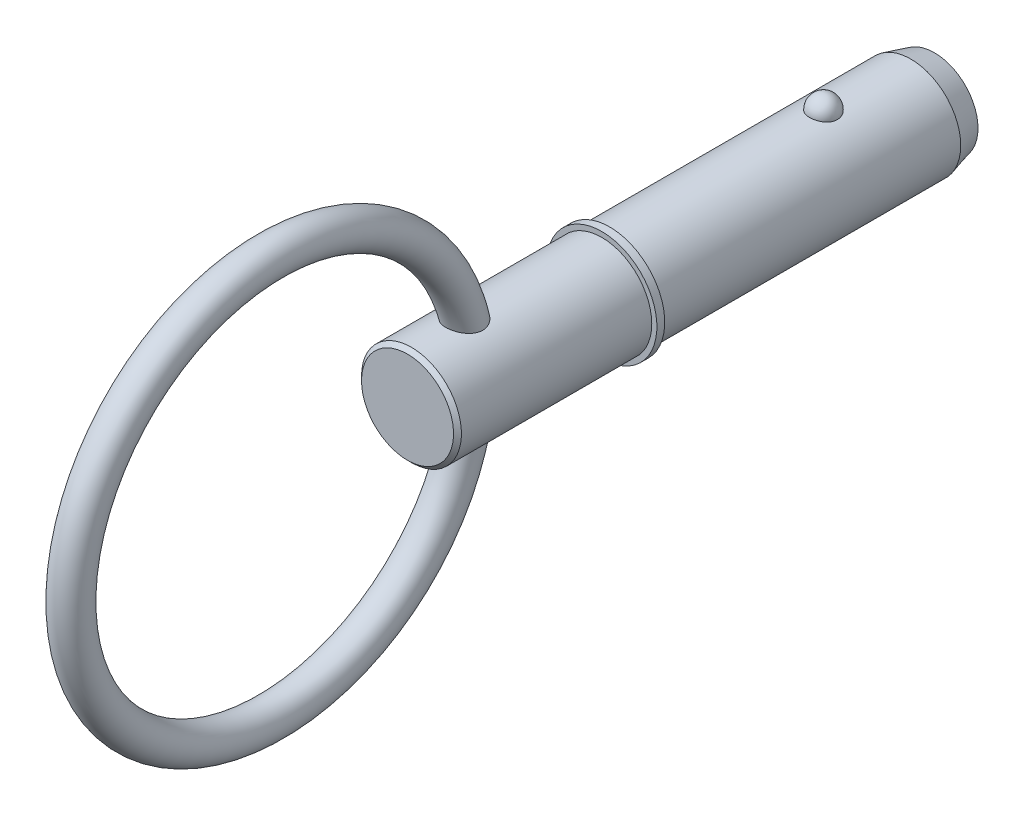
ISO-10303-21;
HEADER;
FILE_DESCRIPTION(('STEP AP214'),'2;1');
FILE_NAME('part.step','',(''),(''),'','','');
FILE_SCHEMA(('AUTOMOTIVE_DESIGN { 1 0 10303 214 1 1 1 1 }'));
ENDSEC;
DATA;
#1=APPLICATION_CONTEXT('core data for automotive mechanical design processes');
#2=APPLICATION_PROTOCOL_DEFINITION('international standard','automotive_design',2000,#1);
#3=PRODUCT_CONTEXT('',#1,'mechanical');
#4=PRODUCT('Part','Part','',(#3));
#5=PRODUCT_RELATED_PRODUCT_CATEGORY('part','',(#4));
#6=PRODUCT_DEFINITION_FORMATION('','',#4);
#7=PRODUCT_DEFINITION_CONTEXT('part definition',#1,'design');
#8=PRODUCT_DEFINITION('design','',#6,#7);
#9=PRODUCT_DEFINITION_SHAPE('','',#8);
#10=(LENGTH_UNIT() NAMED_UNIT(*) SI_UNIT(.MILLI.,.METRE.));
#11=(NAMED_UNIT(*) PLANE_ANGLE_UNIT() SI_UNIT($,.RADIAN.));
#12=(NAMED_UNIT(*) SI_UNIT($,.STERADIAN.) SOLID_ANGLE_UNIT());
#13=UNCERTAINTY_MEASURE_WITH_UNIT(LENGTH_MEASURE(1.E-05),#10,'distance_accuracy_value','');
#14=(GEOMETRIC_REPRESENTATION_CONTEXT(3) GLOBAL_UNCERTAINTY_ASSIGNED_CONTEXT((#13)) GLOBAL_UNIT_ASSIGNED_CONTEXT((#10,
#11,#12)) REPRESENTATION_CONTEXT('',''));
#15=CARTESIAN_POINT('',(0.,0.,0.));
#16=DIRECTION('',(0.,0.,1.));
#17=DIRECTION('',(1.,0.,0.));
#18=AXIS2_PLACEMENT_3D('',#15,#16,#17);
#19=CARTESIAN_POINT('',(0.,0.,25.4));
#20=DIRECTION('',(0.,0.,-1.));
#21=DIRECTION('',(-1.,0.,0.));
#22=AXIS2_PLACEMENT_3D('',#19,#20,#21);
#23=CYLINDRICAL_SURFACE('',#22,6.35);
#24=CARTESIAN_POINT('',(1.76243001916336,6.10051968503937,-1.78));
#25=CARTESIAN_POINT('',(1.76242835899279,6.10052111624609,-1.68050311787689));
#26=CARTESIAN_POINT('',(1.75431593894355,6.1028816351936,-1.58098521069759));
#27=CARTESIAN_POINT('',(1.72206027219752,6.11206037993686,-1.38476972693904));
#28=CARTESIAN_POINT('',(1.69791106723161,6.11888026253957,-1.28807321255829));
#29=CARTESIAN_POINT('',(1.63419596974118,6.13620287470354,-1.10029899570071));
#30=CARTESIAN_POINT('',(1.59463684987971,6.14670398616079,-1.00921884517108));
#31=CARTESIAN_POINT('',(1.50108569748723,6.17021534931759,-0.835161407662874));
#32=CARTESIAN_POINT('',(1.44709398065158,6.18322554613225,-0.752183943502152));
#33=CARTESIAN_POINT('',(1.3257243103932,6.21038081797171,-0.596209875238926));
#34=CARTESIAN_POINT('',(1.2582815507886,6.22453118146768,-0.523264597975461));
#35=CARTESIAN_POINT('',(1.11191624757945,6.25233390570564,-0.389855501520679));
#36=CARTESIAN_POINT('',(1.03299369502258,6.26598626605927,-0.329391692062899));
#37=CARTESIAN_POINT('',(0.866022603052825,6.29123226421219,-0.222793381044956));
#38=CARTESIAN_POINT('',(0.778000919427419,6.30283170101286,-0.176618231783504));
#39=CARTESIAN_POINT('',(0.59510847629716,6.32272058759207,-0.0996905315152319));
#40=CARTESIAN_POINT('',(0.500238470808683,6.33101040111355,-0.0689362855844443));
#41=CARTESIAN_POINT('',(0.308164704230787,6.34323464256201,-0.0241595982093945));
#42=CARTESIAN_POINT('',(0.211033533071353,6.34724467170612,-0.00984637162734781));
#43=CARTESIAN_POINT('',(0.0156629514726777,6.3507318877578,0.00262058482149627));
#44=CARTESIAN_POINT('',(-0.0825763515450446,6.35020951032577,0.000775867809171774));
#45=CARTESIAN_POINT('',(-0.275890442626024,6.34473055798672,-0.018872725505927));
#46=CARTESIAN_POINT('',(-0.370990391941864,6.3398374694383,-0.0364481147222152));
#47=CARTESIAN_POINT('',(-0.556805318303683,6.32622723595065,-0.0867447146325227));
#48=CARTESIAN_POINT('',(-0.647520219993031,6.31751002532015,-0.119466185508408));
#49=CARTESIAN_POINT('',(-0.822606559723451,6.29711353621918,-0.199386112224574));
#50=CARTESIAN_POINT('',(-0.906938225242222,6.28541739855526,-0.246667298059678));
#51=CARTESIAN_POINT('',(-1.06646479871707,6.26032612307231,-0.354365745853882));
#52=CARTESIAN_POINT('',(-1.14165877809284,6.24693081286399,-0.414784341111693));
#53=CARTESIAN_POINT('',(-1.2823514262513,6.21959142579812,-0.548435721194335));
#54=CARTESIAN_POINT('',(-1.34763761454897,6.2056417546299,-0.621891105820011));
#55=CARTESIAN_POINT('',(-1.4651153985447,6.17896241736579,-0.778815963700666));
#56=CARTESIAN_POINT('',(-1.51730606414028,6.16623283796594,-0.862286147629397));
#57=CARTESIAN_POINT('',(-1.60782211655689,6.14325839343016,-1.0379915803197));
#58=CARTESIAN_POINT('',(-1.64598111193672,6.13304379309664,-1.13031660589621));
#59=CARTESIAN_POINT('',(-1.70661885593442,6.11644899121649,-1.32030667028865));
#60=CARTESIAN_POINT('',(-1.72909805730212,6.11006867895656,-1.41797155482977));
#61=CARTESIAN_POINT('',(-1.75775019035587,6.1018881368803,-1.61543246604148));
#62=CARTESIAN_POINT('',(-1.76399136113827,6.10006874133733,-1.71521779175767));
#63=CARTESIAN_POINT('',(-1.76020715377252,6.10116172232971,-1.91445126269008));
#64=CARTESIAN_POINT('',(-1.75018221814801,6.10407397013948,-2.01389941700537));
#65=CARTESIAN_POINT('',(-1.71421005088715,6.11427232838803,-2.20912106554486));
#66=CARTESIAN_POINT('',(-1.68834262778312,6.12153651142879,-2.30491043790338));
#67=CARTESIAN_POINT('',(-1.62139543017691,6.1396067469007,-2.49066180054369));
#68=CARTESIAN_POINT('',(-1.5803150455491,6.15041294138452,-2.58062355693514));
#69=CARTESIAN_POINT('',(-1.48369112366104,6.17443456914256,-2.75271428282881));
#70=CARTESIAN_POINT('',(-1.42806998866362,6.18766281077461,-2.83479789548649));
#71=CARTESIAN_POINT('',(-1.30386620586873,6.21501934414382,-2.98832532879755));
#72=CARTESIAN_POINT('',(-1.23528306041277,6.22914767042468,-3.05976874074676));
#73=CARTESIAN_POINT('',(-1.08663999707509,6.25679135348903,-3.19029656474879));
#74=CARTESIAN_POINT('',(-1.00653826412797,6.27030422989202,-3.24933392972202));
#75=CARTESIAN_POINT('',(-0.837212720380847,6.29514770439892,-3.35304657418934));
#76=CARTESIAN_POINT('',(-0.747989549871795,6.30647845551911,-3.39772286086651));
#77=CARTESIAN_POINT('',(-0.564098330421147,6.32556124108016,-3.47096393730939));
#78=CARTESIAN_POINT('',(-0.469512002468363,6.33335611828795,-3.49972259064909));
#79=CARTESIAN_POINT('',(-0.27663389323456,6.34470628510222,-3.54113722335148));
#80=CARTESIAN_POINT('',(-0.17834256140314,6.34826208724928,-3.55379514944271));
#81=CARTESIAN_POINT('',(0.0171660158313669,6.35071525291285,-3.56255473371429));
#82=CARTESIAN_POINT('',(0.114368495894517,6.34969931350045,-3.55896450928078));
#83=CARTESIAN_POINT('',(0.306746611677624,6.34331695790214,-3.53603383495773));
#84=CARTESIAN_POINT('',(0.401922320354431,6.33795069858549,-3.51669395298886));
#85=CARTESIAN_POINT('',(0.587203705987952,6.32347219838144,-3.4629173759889));
#86=CARTESIAN_POINT('',(0.677327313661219,6.31437430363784,-3.42853846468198));
#87=CARTESIAN_POINT('',(0.850462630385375,6.29339543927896,-3.34564128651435));
#88=CARTESIAN_POINT('',(0.933473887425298,6.2815142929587,-3.29712212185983));
#89=CARTESIAN_POINT('',(1.09144542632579,6.25601750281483,-3.18638742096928));
#90=CARTESIAN_POINT('',(1.16626195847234,6.24237795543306,-3.12397237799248));
#91=CARTESIAN_POINT('',(1.304448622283,6.21497285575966,-2.98755865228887));
#92=CARTESIAN_POINT('',(1.36781676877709,6.20120728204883,-2.91355796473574));
#93=CARTESIAN_POINT('',(1.48252779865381,6.17479923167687,-2.75456133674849));
#94=CARTESIAN_POINT('',(1.53364167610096,6.16218052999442,-2.66939613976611));
#95=CARTESIAN_POINT('',(1.62109397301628,6.13975602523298,-2.49147502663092));
#96=CARTESIAN_POINT('',(1.657437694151,6.12994921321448,-2.39872184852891));
#97=CARTESIAN_POINT('',(1.71127844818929,6.11512175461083,-2.21887622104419));
#98=CARTESIAN_POINT('',(1.73042646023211,6.10968903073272,-2.13230770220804));
#99=CARTESIAN_POINT('',(1.75600284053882,6.10238739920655,-1.95716498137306));
#100=CARTESIAN_POINT('',(1.76243149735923,6.10051841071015,-1.86859082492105));
#101=CARTESIAN_POINT('',(1.76243001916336,6.10051968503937,-1.78));
#102=B_SPLINE_CURVE_WITH_KNOTS('',3,(#24,#25,#26,#27,#28,#29,#30,#31,#32,#33,#34,#35,#36,#37,
#38,#39,#40,#41,#42,#43,#44,#45,#46,#47,#48,#49,#50,#51,#52,#53,#54,#55,#56,#57,#58,#59,#60,#61,
#62,#63,#64,#65,#66,#67,#68,#69,#70,#71,#72,#73,#74,#75,#76,#77,#78,#79,#80,#81,#82,#83,#84,#85,
#86,#87,#88,#89,#90,#91,#92,#93,#94,#95,#96,#97,#98,#99,#100,#101),.UNSPECIFIED.,.T.,.F.,(4,2,2,
2,2,2,2,2,2,2,2,2,2,2,2,2,2,2,2,2,2,2,2,2,2,2,2,2,2,2,2,2,2,2,2,2,2,2,4),(0.,0.298172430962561,
0.596455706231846,0.894608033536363,1.19275383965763,1.49237238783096,1.79199116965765,
2.09074960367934,2.38947519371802,2.68283180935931,2.97616022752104,3.26529599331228,
3.5544367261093,3.84525169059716,4.13609618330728,4.43249276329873,4.72891038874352,
5.02873757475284,5.32855610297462,5.62711261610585,5.92566100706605,6.22271765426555,
6.519786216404,6.81847366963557,7.11717259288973,7.41698459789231,7.71677557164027,
8.01283014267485,8.30884891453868,8.59927798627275,8.88969658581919,9.17900899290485,
9.46833977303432,9.76212836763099,10.0559678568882,10.3549321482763,10.6537890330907,
10.9192841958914,11.1847733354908),.UNSPECIFIED.);
#103=CARTESIAN_POINT('',(1.76243001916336,6.10051968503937,-1.78));
#104=VERTEX_POINT('',#103);
#105=EDGE_CURVE('E102',#104,#104,#102,.T.);
#106=ORIENTED_EDGE('',*,*,#105,.T.);
#107=EDGE_LOOP('',(#106));
#108=FACE_BOUND('',#107,.T.);
#109=CARTESIAN_POINT('',(0.,0.,-12.88));
#110=DIRECTION('',(0.,0.,-1.));
#111=DIRECTION('',(-1.,0.,0.));
#112=AXIS2_PLACEMENT_3D('',#109,#110,#111);
#113=CIRCLE('',#112,6.35);
#114=CARTESIAN_POINT('',(6.35,0.,-12.88));
#115=VERTEX_POINT('',#114);
#116=EDGE_CURVE('E109',#115,#115,#113,.F.);
#117=ORIENTED_EDGE('',*,*,#116,.T.);
#118=EDGE_LOOP('',(#117));
#119=FACE_BOUND('',#118,.T.);
#120=CARTESIAN_POINT('',(0.,0.,25.4));
#121=DIRECTION('',(0.,0.,1.));
#122=DIRECTION('',(1.,0.,0.));
#123=AXIS2_PLACEMENT_3D('',#120,#121,#122);
#124=CIRCLE('',#123,6.35);
#125=CARTESIAN_POINT('',(6.35,0.,25.4));
#126=VERTEX_POINT('',#125);
#127=EDGE_CURVE('E107',#126,#126,#124,.T.);
#128=ORIENTED_EDGE('',*,*,#127,.F.);
#129=EDGE_LOOP('',(#128));
#130=FACE_BOUND('',#129,.T.);
#131=ADVANCED_FACE('F39',(#108,#119,#130),#23,.T.);
#132=CARTESIAN_POINT('',(0.,0.,-15.88));
#133=DIRECTION('',(0.,0.,-1.));
#134=DIRECTION('',(-1.,0.,0.));
#135=AXIS2_PLACEMENT_3D('',#132,#133,#134);
#136=PLANE('',#135);
#137=CARTESIAN_POINT('',(0.,0.,-15.88));
#138=DIRECTION('',(0.,0.,-1.));
#139=DIRECTION('',(-1.,0.,0.));
#140=AXIS2_PLACEMENT_3D('',#137,#138,#139);
#141=CIRCLE('',#140,5.54615242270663);
#142=CARTESIAN_POINT('',(5.54615242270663,0.,-15.88));
#143=VERTEX_POINT('',#142);
#144=EDGE_CURVE('E141',#143,#143,#141,.T.);
#145=ORIENTED_EDGE('',*,*,#144,.T.);
#146=EDGE_LOOP('',(#145));
#147=FACE_BOUND('',#146,.T.);
#148=ADVANCED_FACE('F88',(#147),#136,.T.);
#149=CARTESIAN_POINT('',(0.,0.,-15.88));
#150=DIRECTION('',(0.,0.,1.));
#151=DIRECTION('',(1.,0.,0.));
#152=AXIS2_PLACEMENT_3D('',#149,#150,#151);
#153=CONICAL_SURFACE('',#152,5.54615242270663,0.261799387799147);
#154=CARTESIAN_POINT('',(6.35,0.,-12.88));
#155=CARTESIAN_POINT('',(6.34162658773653,0.,-12.91125));
#156=CARTESIAN_POINT('',(6.33325317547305,0.,-12.9425));
#157=CARTESIAN_POINT('',(6.31650635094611,0.,-13.005));
#158=CARTESIAN_POINT('',(6.30813293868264,0.,-13.03625));
#159=CARTESIAN_POINT('',(6.29138611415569,0.,-13.09875));
#160=CARTESIAN_POINT('',(6.28301270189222,0.,-13.13));
#161=CARTESIAN_POINT('',(6.26626587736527,0.,-13.1925));
#162=CARTESIAN_POINT('',(6.2578924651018,0.,-13.22375));
#163=CARTESIAN_POINT('',(6.24114564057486,0.,-13.28625));
#164=CARTESIAN_POINT('',(6.23277222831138,0.,-13.3175));
#165=CARTESIAN_POINT('',(6.21602540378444,0.,-13.38));
#166=CARTESIAN_POINT('',(6.20765199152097,0.,-13.41125));
#167=CARTESIAN_POINT('',(6.19090516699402,0.,-13.47375));
#168=CARTESIAN_POINT('',(6.18253175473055,0.,-13.505));
#169=CARTESIAN_POINT('',(6.1657849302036,0.,-13.5675));
#170=CARTESIAN_POINT('',(6.15741151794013,0.,-13.59875));
#171=CARTESIAN_POINT('',(6.14066469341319,0.,-13.66125));
#172=CARTESIAN_POINT('',(6.13229128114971,0.,-13.6925));
#173=CARTESIAN_POINT('',(6.11554445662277,0.,-13.755));
#174=CARTESIAN_POINT('',(6.1071710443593,0.,-13.78625));
#175=CARTESIAN_POINT('',(6.09042421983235,0.,-13.84875));
#176=CARTESIAN_POINT('',(6.08205080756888,0.,-13.88));
#177=CARTESIAN_POINT('',(6.06530398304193,0.,-13.9425));
#178=CARTESIAN_POINT('',(6.05693057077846,0.,-13.97375));
#179=CARTESIAN_POINT('',(6.04018374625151,0.,-14.03625));
#180=CARTESIAN_POINT('',(6.03181033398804,0.,-14.0675));
#181=CARTESIAN_POINT('',(6.0150635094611,0.,-14.13));
#182=CARTESIAN_POINT('',(6.00669009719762,0.,-14.16125));
#183=CARTESIAN_POINT('',(5.98994327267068,0.,-14.22375));
#184=CARTESIAN_POINT('',(5.98156986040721,0.,-14.255));
#185=CARTESIAN_POINT('',(5.96482303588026,0.,-14.3175));
#186=CARTESIAN_POINT('',(5.95644962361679,0.,-14.34875));
#187=CARTESIAN_POINT('',(5.93970279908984,0.,-14.41125));
#188=CARTESIAN_POINT('',(5.93132938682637,0.,-14.4425));
#189=CARTESIAN_POINT('',(5.91458256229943,0.,-14.505));
#190=CARTESIAN_POINT('',(5.90620915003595,0.,-14.53625));
#191=CARTESIAN_POINT('',(5.88946232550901,0.,-14.59875));
#192=CARTESIAN_POINT('',(5.88108891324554,0.,-14.63));
#193=CARTESIAN_POINT('',(5.86434208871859,0.,-14.6925));
#194=CARTESIAN_POINT('',(5.85596867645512,0.,-14.72375));
#195=CARTESIAN_POINT('',(5.83922185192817,0.,-14.78625));
#196=CARTESIAN_POINT('',(5.8308484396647,0.,-14.8175));
#197=CARTESIAN_POINT('',(5.81410161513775,0.,-14.88));
#198=CARTESIAN_POINT('',(5.80572820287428,0.,-14.91125));
#199=CARTESIAN_POINT('',(5.78898137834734,0.,-14.97375));
#200=CARTESIAN_POINT('',(5.78060796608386,0.,-15.005));
#201=CARTESIAN_POINT('',(5.76386114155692,0.,-15.0675));
#202=CARTESIAN_POINT('',(5.75548772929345,0.,-15.09875));
#203=CARTESIAN_POINT('',(5.7387409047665,0.,-15.16125));
#204=CARTESIAN_POINT('',(5.73036749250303,0.,-15.1925));
#205=CARTESIAN_POINT('',(5.71362066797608,0.,-15.255));
#206=CARTESIAN_POINT('',(5.70524725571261,0.,-15.28625));
#207=CARTESIAN_POINT('',(5.68850043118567,0.,-15.34875));
#208=CARTESIAN_POINT('',(5.68012701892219,0.,-15.38));
#209=CARTESIAN_POINT('',(5.66338019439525,0.,-15.4425));
#210=CARTESIAN_POINT('',(5.65500678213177,0.,-15.47375));
#211=CARTESIAN_POINT('',(5.63825995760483,0.,-15.53625));
#212=CARTESIAN_POINT('',(5.62988654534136,0.,-15.5675));
#213=CARTESIAN_POINT('',(5.61313972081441,0.,-15.63));
#214=CARTESIAN_POINT('',(5.60476630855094,0.,-15.66125));
#215=CARTESIAN_POINT('',(5.588019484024,0.,-15.72375));
#216=CARTESIAN_POINT('',(5.57964607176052,0.,-15.755));
#217=CARTESIAN_POINT('',(5.56289924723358,0.,-15.8175));
#218=CARTESIAN_POINT('',(5.5545258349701,0.,-15.84875));
#219=CARTESIAN_POINT('',(5.54615242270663,0.,-15.88));
#220=B_SPLINE_CURVE_WITH_KNOTS('',3,(#154,#155,#156,#157,#158,#159,#160,#161,#162,#163,#164,
#165,#166,#167,#168,#169,#170,#171,#172,#173,#174,#175,#176,#177,#178,#179,#180,#181,#182,#183,
#184,#185,#186,#187,#188,#189,#190,#191,#192,#193,#194,#195,#196,#197,#198,#199,#200,#201,#202,
#203,#204,#205,#206,#207,#208,#209,#210,#211,#212,#213,#214,#215,#216,#217,#218,#219),
.UNSPECIFIED.,.F.,.F.,(4,2,2,2,2,2,2,2,2,2,2,2,2,2,2,2,2,2,2,2,2,2,2,2,2,2,2,2,2,2,2,2,4),(0.,
0.0970571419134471,0.194114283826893,0.291171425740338,0.388228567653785,0.485285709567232,
0.582342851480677,0.679399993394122,0.77645713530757,0.873514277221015,0.970571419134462,
1.06762856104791,1.16468570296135,1.2617428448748,1.35879998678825,1.45585712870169,
1.55291427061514,1.64997141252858,1.74702855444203,1.84408569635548,1.94114283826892,
2.03819998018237,2.13525712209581,2.23231426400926,2.32937140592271,2.42642854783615,
2.5234856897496,2.62054283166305,2.71759997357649,2.81465711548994,2.91171425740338,
3.00877139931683,3.10582854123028),.UNSPECIFIED.);
#221=EDGE_CURVE('BSEAM94',#115,#143,#220,.T.);
#222=ORIENTED_EDGE('',*,*,#116,.F.);
#223=ORIENTED_EDGE('',*,*,#144,.F.);
#224=ORIENTED_EDGE('',*,*,#221,.T.);
#225=ORIENTED_EDGE('',*,*,#221,.F.);
#226=EDGE_LOOP('',(#222,#224,#223,#225));
#227=FACE_BOUND('',#226,.T.);
#228=ADVANCED_FACE('F94',(#227),#153,.T.);
#229=CARTESIAN_POINT('',(0.,6.35,-1.78));
#230=DIRECTION('',(0.,1.,0.));
#231=DIRECTION('',(0.,0.,1.));
#232=AXIS2_PLACEMENT_3D('',#229,#230,#231);
#233=SPHERICAL_SURFACE('',#232,1.78);
#234=ORIENTED_EDGE('',*,*,#105,.F.);
#235=EDGE_LOOP('',(#234));
#236=FACE_BOUND('',#235,.T.);
#237=ADVANCED_FACE('F112',(#236),#233,.T.);
#238=CARTESIAN_POINT('',(0.,0.,25.4));
#239=DIRECTION('',(0.,0.,-1.));
#240=DIRECTION('',(-1.,0.,0.));
#241=AXIS2_PLACEMENT_3D('',#238,#239,#240);
#242=PLANE('',#241);
#243=ORIENTED_EDGE('',*,*,#127,.T.);
#244=EDGE_LOOP('',(#243));
#245=FACE_BOUND('',#244,.T.);
#246=CARTESIAN_POINT('',(0.,0.,25.4));
#247=DIRECTION('',(0.,0.,-1.));
#248=DIRECTION('',(-1.,0.,0.));
#249=AXIS2_PLACEMENT_3D('',#246,#247,#248);
#250=CIRCLE('',#249,7.);
#251=CARTESIAN_POINT('',(-7.,0.,25.4));
#252=VERTEX_POINT('',#251);
#253=EDGE_CURVE('E108',#252,#252,#250,.T.);
#254=ORIENTED_EDGE('',*,*,#253,.T.);
#255=EDGE_LOOP('',(#254));
#256=FACE_BOUND('',#255,.T.);
#257=ADVANCED_FACE('F116',(#245,#256),#242,.T.);
#258=CARTESIAN_POINT('',(0.,0.,33.7287874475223));
#259=DIRECTION('',(0.,0.,-1.));
#260=DIRECTION('',(-1.,0.,0.));
#261=AXIS2_PLACEMENT_3D('',#258,#259,#260);
#262=CYLINDRICAL_SURFACE('',#261,7.);
#263=CARTESIAN_POINT('',(0.,0.,26.4));
#264=DIRECTION('',(0.,0.,-1.));
#265=DIRECTION('',(-1.,0.,0.));
#266=AXIS2_PLACEMENT_3D('',#263,#264,#265);
#267=CIRCLE('',#266,7.);
#268=CARTESIAN_POINT('',(-7.,0.,26.4));
#269=VERTEX_POINT('',#268);
#270=EDGE_CURVE('E133',#269,#269,#267,.T.);
#271=ORIENTED_EDGE('',*,*,#270,.T.);
#272=EDGE_LOOP('',(#271));
#273=FACE_BOUND('',#272,.T.);
#274=ORIENTED_EDGE('',*,*,#253,.F.);
#275=EDGE_LOOP('',(#274));
#276=FACE_BOUND('',#275,.T.);
#277=ADVANCED_FACE('F120',(#273,#276),#262,.T.);
#278=CARTESIAN_POINT('',(0.,7.,26.4));
#279=DIRECTION('',(0.,0.,1.));
#280=DIRECTION('',(1.,0.,0.));
#281=AXIS2_PLACEMENT_3D('',#278,#279,#280);
#282=PLANE('',#281);
#283=CARTESIAN_POINT('',(0.,0.,26.4));
#284=DIRECTION('',(0.,0.,1.));
#285=DIRECTION('',(1.,0.,0.));
#286=AXIS2_PLACEMENT_3D('',#283,#284,#285);
#287=CIRCLE('',#286,6.35);
#288=CARTESIAN_POINT('',(6.35,0.,26.4));
#289=VERTEX_POINT('',#288);
#290=EDGE_CURVE('E111',#289,#289,#287,.T.);
#291=ORIENTED_EDGE('',*,*,#290,.F.);
#292=EDGE_LOOP('',(#291));
#293=FACE_BOUND('',#292,.T.);
#294=ORIENTED_EDGE('',*,*,#270,.F.);
#295=EDGE_LOOP('',(#294));
#296=FACE_BOUND('',#295,.T.);
#297=ADVANCED_FACE('F85',(#293,#296),#282,.T.);
#298=CARTESIAN_POINT('',(0.,0.,51.1));
#299=DIRECTION('',(0.,0.,-1.));
#300=DIRECTION('',(-1.,0.,0.));
#301=AXIS2_PLACEMENT_3D('',#298,#299,#300);
#302=CYLINDRICAL_SURFACE('',#301,6.35);
#303=CARTESIAN_POINT('',(-1.08120660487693,-6.25727514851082,41.8515811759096));
#304=CARTESIAN_POINT('',(-0.970724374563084,-6.27636409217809,41.7938798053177));
#305=CARTESIAN_POINT('',(-0.855136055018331,-6.29329984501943,41.7452195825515));
#306=CARTESIAN_POINT('',(-0.6169586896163,-6.32109419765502,41.6670559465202));
#307=CARTESIAN_POINT('',(-0.494369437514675,-6.3319526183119,41.6375530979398));
#308=CARTESIAN_POINT('',(-0.245606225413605,-6.34647141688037,41.5983673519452));
#309=CARTESIAN_POINT('',(-0.119431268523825,-6.35012977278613,41.5886900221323));
#310=CARTESIAN_POINT('',(0.132849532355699,-6.34986313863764,41.5894002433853));
#311=CARTESIAN_POINT('',(0.258955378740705,-6.34593843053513,41.5997870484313));
#312=CARTESIAN_POINT('',(0.506912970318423,-6.33094785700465,41.6402854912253));
#313=CARTESIAN_POINT('',(0.628781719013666,-6.31991516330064,41.6703055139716));
#314=CARTESIAN_POINT('',(0.865486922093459,-6.29187143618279,41.7493088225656));
#315=CARTESIAN_POINT('',(0.980322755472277,-6.27485987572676,41.798293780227));
#316=CARTESIAN_POINT('',(1.20050616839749,-6.23649440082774,41.9145408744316));
#317=CARTESIAN_POINT('',(1.30578867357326,-6.21511352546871,41.9819174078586));
#318=CARTESIAN_POINT('',(1.50311440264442,-6.17036440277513,42.1333596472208));
#319=CARTESIAN_POINT('',(1.59515714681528,-6.14699608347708,42.2174259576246));
#320=CARTESIAN_POINT('',(1.76326863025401,-6.10090072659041,42.4002474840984));
#321=CARTESIAN_POINT('',(1.83935482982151,-6.07817301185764,42.4989864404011));
#322=CARTESIAN_POINT('',(1.97338559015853,-6.03599268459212,42.708703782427));
#323=CARTESIAN_POINT('',(2.03133638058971,-6.01653894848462,42.8196779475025));
#324=CARTESIAN_POINT('',(2.1259120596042,-5.98376466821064,43.047018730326));
#325=CARTESIAN_POINT('',(2.16315310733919,-5.97026970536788,43.1631040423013));
#326=CARTESIAN_POINT('',(2.21830650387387,-5.94999923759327,43.4003187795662));
#327=CARTESIAN_POINT('',(2.2362211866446,-5.94322292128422,43.5214475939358));
#328=CARTESIAN_POINT('',(2.25273772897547,-5.93698111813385,43.7632812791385));
#329=CARTESIAN_POINT('',(2.25163224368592,-5.93740484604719,43.8839640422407));
#330=CARTESIAN_POINT('',(2.23167546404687,-5.94493297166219,44.1236203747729));
#331=CARTESIAN_POINT('',(2.21281883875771,-5.9520393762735,44.2425934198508));
#332=CARTESIAN_POINT('',(2.15679576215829,-5.97257680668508,44.483836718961));
#333=CARTESIAN_POINT('',(2.11851138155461,-5.98639144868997,44.6058128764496));
#334=CARTESIAN_POINT('',(2.02470263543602,-6.01876484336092,44.8422848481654));
#335=CARTESIAN_POINT('',(1.96916879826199,-6.03732620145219,44.9567765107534));
#336=CARTESIAN_POINT('',(1.8352662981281,-6.07945247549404,45.1879958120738));
#337=CARTESIAN_POINT('',(1.75507038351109,-6.10334207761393,45.3036110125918));
#338=CARTESIAN_POINT('',(1.57657889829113,-6.1518655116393,45.5198949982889));
#339=CARTESIAN_POINT('',(1.47827192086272,-6.17649980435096,45.6205542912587));
#340=CARTESIAN_POINT('',(1.26306696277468,-6.22410762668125,45.8050235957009));
#341=CARTESIAN_POINT('',(1.14585214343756,-6.24704086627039,45.8884783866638));
#342=CARTESIAN_POINT('',(0.896825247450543,-6.28760987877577,46.031400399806));
#343=CARTESIAN_POINT('',(0.765036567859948,-6.30525397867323,46.0909053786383));
#344=CARTESIAN_POINT('',(0.509454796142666,-6.330648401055,46.1752631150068));
#345=CARTESIAN_POINT('',(0.386964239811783,-6.33940909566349,46.2036959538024));
#346=CARTESIAN_POINT('',(0.200813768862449,-6.3471308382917,46.2286800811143));
#347=CARTESIAN_POINT('',(0.138353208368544,-6.34880140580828,46.234063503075));
#348=CARTESIAN_POINT('',(0.0131841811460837,-6.35029448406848,46.2388738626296));
#349=CARTESIAN_POINT('',(-0.0495242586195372,-6.35011719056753,46.2383014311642));
#350=CARTESIAN_POINT('',(-0.21986066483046,-6.34710452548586,46.2285979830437));
#351=CARTESIAN_POINT('',(-0.327176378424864,-6.34243953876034,46.2135767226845));
#352=CARTESIAN_POINT('',(-0.537619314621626,-6.32808248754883,46.166673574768));
#353=CARTESIAN_POINT('',(-0.640746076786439,-6.31838987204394,46.1347898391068));
#354=CARTESIAN_POINT('',(-0.841795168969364,-6.29478075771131,46.0553379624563));
#355=CARTESIAN_POINT('',(-0.939631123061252,-6.28081033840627,46.00756888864));
#356=CARTESIAN_POINT('',(-1.12690564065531,-6.2499288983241,45.8985138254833));
#357=CARTESIAN_POINT('',(-1.21634109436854,-6.2330167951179,45.837222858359));
#358=CARTESIAN_POINT('',(-1.3971303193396,-6.19517308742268,45.6940397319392));
#359=CARTESIAN_POINT('',(-1.48711596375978,-6.17400700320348,45.6104839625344));
#360=CARTESIAN_POINT('',(-1.65373642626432,-6.13148145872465,45.430996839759));
#361=CARTESIAN_POINT('',(-1.73036130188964,-6.11012186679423,45.3350563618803));
#362=CARTESIAN_POINT('',(-1.87908981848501,-6.06616529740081,45.1186208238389));
#363=CARTESIAN_POINT('',(-1.94902044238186,-6.04382072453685,44.9965721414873));
#364=CARTESIAN_POINT('',(-2.06849605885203,-6.00398244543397,44.7420700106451));
#365=CARTESIAN_POINT('',(-2.11803457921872,-5.98649027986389,44.6096132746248));
#366=CARTESIAN_POINT('',(-2.19551930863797,-5.95851933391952,44.3345936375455));
#367=CARTESIAN_POINT('',(-2.22297667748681,-5.94819998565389,44.1918743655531));
#368=CARTESIAN_POINT('',(-2.25222139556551,-5.93719450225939,43.9034800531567));
#369=CARTESIAN_POINT('',(-2.25403508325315,-5.93649848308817,43.7578081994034));
#370=CARTESIAN_POINT('',(-2.23178480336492,-5.94489150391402,43.4838044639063));
#371=CARTESIAN_POINT('',(-2.21035650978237,-5.95298402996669,43.3552268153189));
#372=CARTESIAN_POINT('',(-2.14565882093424,-5.97660650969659,43.1044089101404));
#373=CARTESIAN_POINT('',(-2.10239634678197,-5.99213410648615,42.9821666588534));
#374=CARTESIAN_POINT('',(-1.99913159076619,-6.02732890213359,42.7567478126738));
#375=CARTESIAN_POINT('',(-1.94060271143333,-6.04660536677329,42.6528298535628));
#376=CARTESIAN_POINT('',(-1.80736340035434,-6.08775699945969,42.456534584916));
#377=CARTESIAN_POINT('',(-1.73265259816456,-6.10963222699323,42.3641575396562));
#378=CARTESIAN_POINT('',(-1.56865095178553,-6.15378470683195,42.1926034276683));
#379=CARTESIAN_POINT('',(-1.47928749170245,-6.17606344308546,42.1134962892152));
#380=CARTESIAN_POINT('',(-1.28858731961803,-6.21864788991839,41.9706753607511));
#381=CARTESIAN_POINT('',(-1.18724893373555,-6.23895332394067,41.9069637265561));
#382=CARTESIAN_POINT('',(-1.08120660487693,-6.25727514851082,41.8515811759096));
#383=B_SPLINE_CURVE_WITH_KNOTS('',3,(#303,#304,#305,#306,#307,#308,#309,#310,#311,#312,#313,
#314,#315,#316,#317,#318,#319,#320,#321,#322,#323,#324,#325,#326,#327,#328,#329,#330,#331,#332,
#333,#334,#335,#336,#337,#338,#339,#340,#341,#342,#343,#344,#345,#346,#347,#348,#349,#350,#351,
#352,#353,#354,#355,#356,#357,#358,#359,#360,#361,#362,#363,#364,#365,#366,#367,#368,#369,#370,
#371,#372,#373,#374,#375,#376,#377,#378,#379,#380,#381,#382),.UNSPECIFIED.,.T.,.F.,(4,2,2,2,2,2,
2,2,2,2,2,2,2,2,2,2,2,2,2,2,2,2,2,2,2,2,2,2,2,2,2,2,2,2,2,2,2,2,2,4),(0.,0.377861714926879,
0.755734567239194,1.13371352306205,1.51167842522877,1.88789208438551,2.26413891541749,
2.64278156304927,3.02143792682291,3.3996777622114,3.77778752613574,4.14394628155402,
4.51006081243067,4.87054720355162,5.23114188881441,5.61534494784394,5.99975934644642,
6.42600522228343,6.85252048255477,7.28711365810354,7.72101899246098,8.09666132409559,
8.28452949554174,8.47237776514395,8.79607953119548,9.11981678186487,9.44781545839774,
9.77593508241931,10.1483085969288,10.5209580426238,10.9463240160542,11.3718248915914,
11.8065046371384,12.2407378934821,12.6304236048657,13.0199858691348,13.3807583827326,
13.7415391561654,14.104165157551,14.4668419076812),.UNSPECIFIED.);
#384=CARTESIAN_POINT('',(-1.08120660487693,-6.25727514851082,41.8515811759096));
#385=VERTEX_POINT('',#384);
#386=EDGE_CURVE('E10',#385,#385,#383,.T.);
#387=ORIENTED_EDGE('',*,*,#386,.F.);
#388=EDGE_LOOP('',(#387));
#389=FACE_BOUND('',#388,.T.);
#390=CARTESIAN_POINT('',(-1.08120660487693,6.25727514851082,41.8515811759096));
#391=CARTESIAN_POINT('',(-1.19093168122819,6.23831652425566,41.908887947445));
#392=CARTESIAN_POINT('',(-1.29562751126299,6.21723224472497,41.9751167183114));
#393=CARTESIAN_POINT('',(-1.49211272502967,6.17302620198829,42.124020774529));
#394=CARTESIAN_POINT('',(-1.58390200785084,6.14990442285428,42.2066961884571));
#395=CARTESIAN_POINT('',(-1.7520969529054,6.10411985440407,42.3867778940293));
#396=CARTESIAN_POINT('',(-1.82848346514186,6.08145766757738,42.4842022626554));
#397=CARTESIAN_POINT('',(-1.96346259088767,6.0392331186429,42.6912733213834));
#398=CARTESIAN_POINT('',(-2.02206050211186,6.01966983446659,42.8009163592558));
#399=CARTESIAN_POINT('',(-2.11860444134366,5.9863659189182,43.0265649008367));
#400=CARTESIAN_POINT('',(-2.15701637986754,5.97249571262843,43.1423519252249));
#401=CARTESIAN_POINT('',(-2.21449304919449,5.95142584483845,43.3791911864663));
#402=CARTESIAN_POINT('',(-2.23356015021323,5.94422536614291,43.5002427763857));
#403=CARTESIAN_POINT('',(-2.25228141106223,5.93715610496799,43.7419445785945));
#404=CARTESIAN_POINT('',(-2.25225786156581,5.93716560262,43.8625670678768));
#405=CARTESIAN_POINT('',(-2.2344206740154,5.94389982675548,44.1022777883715));
#406=CARTESIAN_POINT('',(-2.21660184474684,5.95062651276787,44.2213655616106));
#407=CARTESIAN_POINT('',(-2.16272689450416,5.97042554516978,44.4627056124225));
#408=CARTESIAN_POINT('',(-2.12559286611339,5.98387086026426,44.5846848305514));
#409=CARTESIAN_POINT('',(-2.03409944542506,6.0155857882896,44.821342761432));
#410=CARTESIAN_POINT('',(-1.97973080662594,6.03385799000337,44.9360175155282));
#411=CARTESIAN_POINT('',(-1.84828023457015,6.07549301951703,45.1678654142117));
#412=CARTESIAN_POINT('',(-1.76936622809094,6.09919386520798,45.2839437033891));
#413=CARTESIAN_POINT('',(-1.59344783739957,6.14749881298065,45.5014208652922));
#414=CARTESIAN_POINT('',(-1.49643151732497,6.17210350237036,45.6028099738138));
#415=CARTESIAN_POINT('',(-1.28333318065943,6.21994692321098,45.7895083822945));
#416=CARTESIAN_POINT('',(-1.1668572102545,6.24314005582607,45.8743845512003));
#417=CARTESIAN_POINT('',(-0.919062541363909,6.2843871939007,46.0203440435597));
#418=CARTESIAN_POINT('',(-0.787766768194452,6.30244898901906,46.0814634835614));
#419=CARTESIAN_POINT('',(-0.532335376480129,6.32876911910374,46.1691112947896));
#420=CARTESIAN_POINT('',(-0.40951692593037,6.33800211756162,46.1991235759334));
#421=CARTESIAN_POINT('',(-0.222636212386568,6.34640533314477,46.2263386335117));
#422=CARTESIAN_POINT('',(-0.159893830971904,6.34829860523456,46.2324428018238));
#423=CARTESIAN_POINT('',(-0.0340877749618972,6.35021985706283,46.2386341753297));
#424=CARTESIAN_POINT('',(0.0289758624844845,6.35024804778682,46.2387220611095));
#425=CARTESIAN_POINT('',(0.200008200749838,6.34776620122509,46.230732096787));
#426=CARTESIAN_POINT('',(0.307730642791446,6.34342046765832,46.2167500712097));
#427=CARTESIAN_POINT('',(0.519134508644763,6.32963338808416,46.1717653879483));
#428=CARTESIAN_POINT('',(0.622815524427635,6.3201915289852,46.1407610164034));
#429=CARTESIAN_POINT('',(0.824580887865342,6.2970603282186,46.0630869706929));
#430=CARTESIAN_POINT('',(0.922611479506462,6.28333629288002,46.0162890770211));
#431=CARTESIAN_POINT('',(1.11039970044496,6.2528858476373,45.9091226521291));
#432=CARTESIAN_POINT('',(1.20015435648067,6.23615836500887,45.8487492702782));
#433=CARTESIAN_POINT('',(1.38155818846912,6.19866747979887,45.7076024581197));
#434=CARTESIAN_POINT('',(1.47187645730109,6.17766310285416,45.6251847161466));
#435=CARTESIAN_POINT('',(1.63933626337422,6.13535258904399,45.4479469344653));
#436=CARTESIAN_POINT('',(1.71646809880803,6.11404624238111,45.3531178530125));
#437=CARTESIAN_POINT('',(1.86660460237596,6.07002946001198,45.138851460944));
#438=CARTESIAN_POINT('',(1.93743710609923,6.04755477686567,45.0178347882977));
#439=CARTESIAN_POINT('',(2.05894300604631,6.00727604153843,44.7652808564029));
#440=CARTESIAN_POINT('',(2.10960917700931,5.98947366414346,44.6337398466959));
#441=CARTESIAN_POINT('',(2.18982014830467,5.96062717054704,44.3597589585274));
#442=CARTESIAN_POINT('',(2.21877575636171,5.94977267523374,44.2171236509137));
#443=CARTESIAN_POINT('',(2.25104759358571,5.93764416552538,43.9285958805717));
#444=CARTESIAN_POINT('',(2.25438985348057,5.93636042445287,43.7827068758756));
#445=CARTESIAN_POINT('',(2.23498011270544,5.94368858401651,43.5077311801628));
#446=CARTESIAN_POINT('',(2.21482640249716,5.95131530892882,43.3784341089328));
#447=CARTESIAN_POINT('',(2.15248760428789,5.97414352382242,43.1259695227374));
#448=CARTESIAN_POINT('',(2.11031020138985,5.98934237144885,43.0027998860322));
#449=CARTESIAN_POINT('',(2.00904610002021,6.02402214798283,42.7757832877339));
#450=CARTESIAN_POINT('',(1.95150192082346,6.04308594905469,42.6711789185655));
#451=CARTESIAN_POINT('',(1.82009972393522,6.08395083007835,42.4733823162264));
#452=CARTESIAN_POINT('',(1.74624088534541,6.10575204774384,42.3801906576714));
#453=CARTESIAN_POINT('',(1.58309476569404,6.15008431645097,42.2061646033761));
#454=CARTESIAN_POINT('',(1.49360904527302,6.17262128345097,42.1255180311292));
#455=CARTESIAN_POINT('',(1.30231515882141,6.21579297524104,41.9798366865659));
#456=CARTESIAN_POINT('',(1.20050521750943,6.23642742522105,41.9148041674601));
#457=CARTESIAN_POINT('',(0.98378657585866,6.27432316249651,41.7998596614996));
#458=CARTESIAN_POINT('',(0.868563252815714,6.29145558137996,41.7504972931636));
#459=CARTESIAN_POINT('',(0.630994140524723,6.31970327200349,41.6708857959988));
#460=CARTESIAN_POINT('',(0.508648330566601,6.33081852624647,41.6406367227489));
#461=CARTESIAN_POINT('',(0.259933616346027,6.34590352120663,41.5998795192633));
#462=CARTESIAN_POINT('',(0.133554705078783,6.34985380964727,41.5894251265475));
#463=CARTESIAN_POINT('',(-0.119270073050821,6.35013815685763,41.5886676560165));
#464=CARTESIAN_POINT('',(-0.245715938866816,6.34647233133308,41.5983642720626));
#465=CARTESIAN_POINT('',(-0.494670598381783,6.33192772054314,41.6376209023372));
#466=CARTESIAN_POINT('',(-0.617189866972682,6.3210701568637,41.6671224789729));
#467=CARTESIAN_POINT('',(-0.855240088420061,6.29328476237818,41.7452630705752));
#468=CARTESIAN_POINT('',(-0.97077065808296,6.27635659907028,41.7939031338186));
#469=CARTESIAN_POINT('',(-1.08120660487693,6.25727514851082,41.8515811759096));
#470=B_SPLINE_CURVE_WITH_KNOTS('',3,(#390,#391,#392,#393,#394,#395,#396,#397,#398,#399,#400,
#401,#402,#403,#404,#405,#406,#407,#408,#409,#410,#411,#412,#413,#414,#415,#416,#417,#418,#419,
#420,#421,#422,#423,#424,#425,#426,#427,#428,#429,#430,#431,#432,#433,#434,#435,#436,#437,#438,
#439,#440,#441,#442,#443,#444,#445,#446,#447,#448,#449,#450,#451,#452,#453,#454,#455,#456,#457,
#458,#459,#460,#461,#462,#463,#464,#465,#466,#467,#468,#469),.UNSPECIFIED.,.T.,.F.,(4,2,2,2,2,2,
2,2,2,2,2,2,2,2,2,2,2,2,2,2,2,2,2,2,2,2,2,2,2,2,2,2,2,2,2,2,2,2,2,4),(0.,0.375258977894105,
0.750520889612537,1.12624651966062,1.50186014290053,1.86837438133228,2.23484370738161,
2.59512638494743,2.95551419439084,3.33859924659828,3.72189017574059,4.14704029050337,
4.5724717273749,5.00788576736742,5.44263524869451,5.82040093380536,6.00932292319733,
6.19822354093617,6.5226607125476,6.84713055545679,7.17430063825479,7.50158780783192,
7.87233275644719,8.24334931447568,8.66748794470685,9.09177840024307,9.52720369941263,
9.96218641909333,10.3532895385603,10.7442562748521,11.1052784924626,11.4663188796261,
11.8323306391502,12.1983951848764,12.5761580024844,12.9539219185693,13.3327099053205,
13.7114921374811,14.0891615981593,14.4668517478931),.UNSPECIFIED.);
#471=CARTESIAN_POINT('',(-1.08120660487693,6.25727514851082,41.8515811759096));
#472=VERTEX_POINT('',#471);
#473=EDGE_CURVE('E51',#472,#472,#470,.T.);
#474=ORIENTED_EDGE('',*,*,#473,.F.);
#475=EDGE_LOOP('',(#474));
#476=FACE_BOUND('',#475,.T.);
#477=CARTESIAN_POINT('',(0.,0.,50.6));
#478=DIRECTION('',(0.,0.,-1.));
#479=DIRECTION('',(-1.,0.,0.));
#480=AXIS2_PLACEMENT_3D('',#477,#478,#479);
#481=CIRCLE('',#480,6.35);
#482=CARTESIAN_POINT('',(-6.35,0.,50.6));
#483=VERTEX_POINT('',#482);
#484=EDGE_CURVE('E64',#483,#483,#481,.T.);
#485=ORIENTED_EDGE('',*,*,#484,.T.);
#486=EDGE_LOOP('',(#485));
#487=FACE_BOUND('',#486,.T.);
#488=ORIENTED_EDGE('',*,*,#290,.T.);
#489=EDGE_LOOP('',(#488));
#490=FACE_BOUND('',#489,.T.);
#491=ADVANCED_FACE('F69',(#389,#476,#487,#490),#302,.T.);
#492=CARTESIAN_POINT('',(0.,0.,51.1));
#493=DIRECTION('',(0.,0.,-1.));
#494=DIRECTION('',(-1.,0.,0.));
#495=AXIS2_PLACEMENT_3D('',#492,#493,#494);
#496=PLANE('',#495);
#497=CARTESIAN_POINT('',(0.,0.,51.1));
#498=DIRECTION('',(0.,0.,-1.));
#499=DIRECTION('',(-1.,0.,0.));
#500=AXIS2_PLACEMENT_3D('',#497,#498,#499);
#501=CIRCLE('',#500,5.84999999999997);
#502=CARTESIAN_POINT('',(-5.84999999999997,0.,51.1));
#503=VERTEX_POINT('',#502);
#504=EDGE_CURVE('E58',#503,#503,#501,.F.);
#505=ORIENTED_EDGE('',*,*,#504,.T.);
#506=EDGE_LOOP('',(#505));
#507=FACE_BOUND('',#506,.T.);
#508=ADVANCED_FACE('F76',(#507),#496,.F.);
#509=CARTESIAN_POINT('',(0.,0.,50.6));
#510=DIRECTION('',(0.,0.,-1.));
#511=DIRECTION('',(-1.,0.,0.));
#512=AXIS2_PLACEMENT_3D('',#509,#510,#511);
#513=CONICAL_SURFACE('',#512,6.35,0.785398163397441);
#514=ORIENTED_EDGE('',*,*,#504,.F.);
#515=EDGE_LOOP('',(#514));
#516=FACE_BOUND('',#515,.T.);
#517=ORIENTED_EDGE('',*,*,#484,.F.);
#518=EDGE_LOOP('',(#517));
#519=FACE_BOUND('',#518,.T.);
#520=ADVANCED_FACE('F41',(#516,#519),#513,.T.);
#521=CARTESIAN_POINT('',(0.,0.,68.5));
#522=DIRECTION('',(1.,0.,0.));
#523=DIRECTION('',(0.,0.,-1.));
#524=AXIS2_PLACEMENT_3D('',#521,#522,#523);
#525=TOROIDAL_SURFACE('',#524,25.4,2.25);
#526=ORIENTED_EDGE('',*,*,#386,.T.);
#527=EDGE_LOOP('',(#526));
#528=FACE_BOUND('',#527,.T.);
#529=ORIENTED_EDGE('',*,*,#473,.T.);
#530=EDGE_LOOP('',(#529));
#531=FACE_BOUND('',#530,.T.);
#532=ADVANCED_FACE('F73',(#528,#531),#525,.T.);
#533=CLOSED_SHELL('',(#131,#148,#228,#237,#257,#277,#297,#491,#508,#520,#532));
#534=MANIFOLD_SOLID_BREP('B2',#533);
#535=ADVANCED_BREP_SHAPE_REPRESENTATION('',(#18,#534),#14);
#536=SHAPE_DEFINITION_REPRESENTATION(#9,#535);
ENDSEC;
END-ISO-10303-21;
